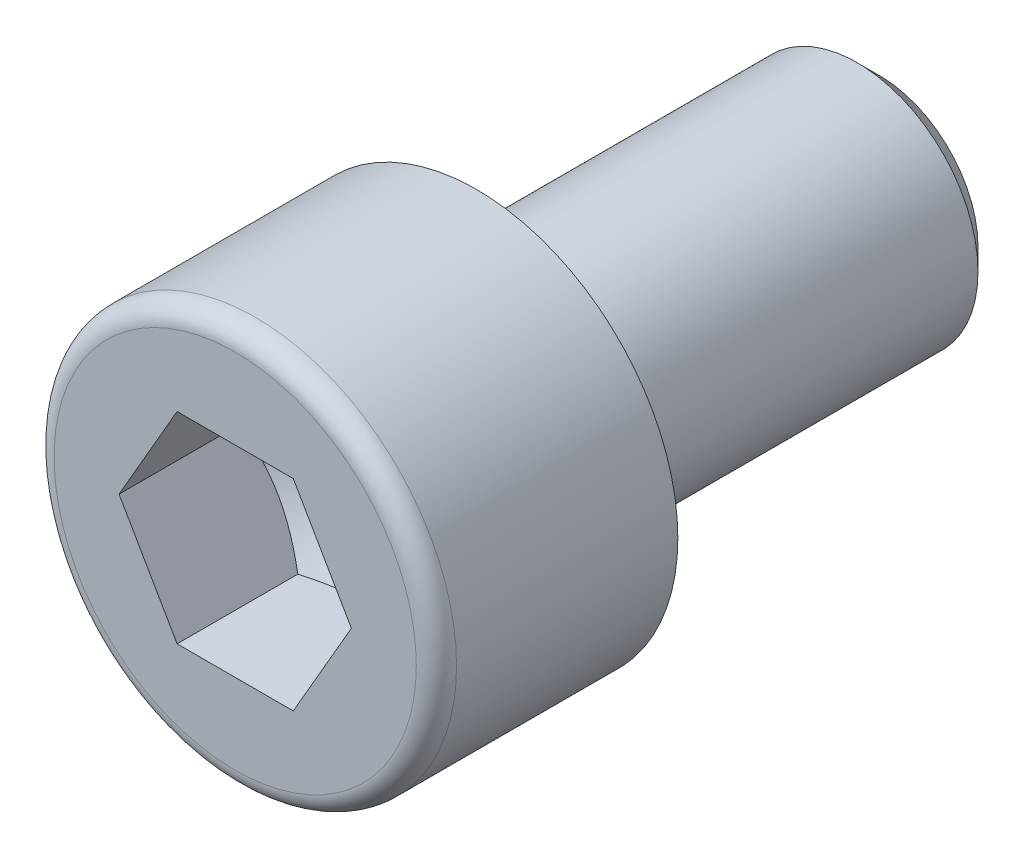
ISO-10303-21;
HEADER;
FILE_DESCRIPTION(('STEP AP214'),'2;1');
FILE_NAME('part.step','',(''),(''),'','','');
FILE_SCHEMA(('AUTOMOTIVE_DESIGN { 1 0 10303 214 1 1 1 1 }'));
ENDSEC;
DATA;
#1=APPLICATION_CONTEXT('core data for automotive mechanical design processes');
#2=APPLICATION_PROTOCOL_DEFINITION('international standard','automotive_design',2000,#1);
#3=PRODUCT_CONTEXT('',#1,'mechanical');
#4=PRODUCT('Part','Part','',(#3));
#5=PRODUCT_RELATED_PRODUCT_CATEGORY('part','',(#4));
#6=PRODUCT_DEFINITION_FORMATION('','',#4);
#7=PRODUCT_DEFINITION_CONTEXT('part definition',#1,'design');
#8=PRODUCT_DEFINITION('design','',#6,#7);
#9=PRODUCT_DEFINITION_SHAPE('','',#8);
#10=(LENGTH_UNIT() NAMED_UNIT(*) SI_UNIT(.MILLI.,.METRE.));
#11=(NAMED_UNIT(*) PLANE_ANGLE_UNIT() SI_UNIT($,.RADIAN.));
#12=(NAMED_UNIT(*) SI_UNIT($,.STERADIAN.) SOLID_ANGLE_UNIT());
#13=UNCERTAINTY_MEASURE_WITH_UNIT(LENGTH_MEASURE(1.E-05),#10,'distance_accuracy_value','');
#14=(GEOMETRIC_REPRESENTATION_CONTEXT(3) GLOBAL_UNCERTAINTY_ASSIGNED_CONTEXT((#13)) GLOBAL_UNIT_ASSIGNED_CONTEXT((#10,
#11,#12)) REPRESENTATION_CONTEXT('',''));
#15=CARTESIAN_POINT('',(0.,0.,0.));
#16=DIRECTION('',(0.,0.,1.));
#17=DIRECTION('',(1.,0.,0.));
#18=AXIS2_PLACEMENT_3D('',#15,#16,#17);
#19=CARTESIAN_POINT('',(0.,0.,6.));
#20=DIRECTION('',(0.,0.,1.));
#21=DIRECTION('',(1.,0.,0.));
#22=AXIS2_PLACEMENT_3D('',#19,#20,#21);
#23=PLANE('',#22);
#24=CARTESIAN_POINT('',(0.,0.,6.));
#25=DIRECTION('',(0.,0.,1.));
#26=DIRECTION('',(1.,0.,0.));
#27=AXIS2_PLACEMENT_3D('',#24,#25,#26);
#28=CIRCLE('',#27,4.5);
#29=CARTESIAN_POINT('',(4.5,0.,6.));
#30=VERTEX_POINT('',#29);
#31=EDGE_CURVE('E11',#30,#30,#28,.T.);
#32=ORIENTED_EDGE('',*,*,#31,.T.);
#33=EDGE_LOOP('',(#32));
#34=FACE_BOUND('',#33,.T.);
#35=DIRECTION('',(1.,0.,0.));
#36=VECTOR('',#35,1.);
#37=CARTESIAN_POINT('',(-1.44337499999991,2.49999883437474,6.));
#38=LINE('',#37,#36);
#39=CARTESIAN_POINT('',(-1.44337499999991,2.49999883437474,6.));
#40=VERTEX_POINT('',#39);
#41=CARTESIAN_POINT('',(1.44337500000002,2.49999883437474,5.99999999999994));
#42=VERTEX_POINT('',#41);
#43=EDGE_CURVE('E92',#40,#42,#38,.T.);
#44=ORIENTED_EDGE('',*,*,#43,.T.);
#45=DIRECTION('',(0.500000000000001,-0.866025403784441,0.));
#46=VECTOR('',#45,1.);
#47=CARTESIAN_POINT('',(1.44337500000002,2.49999883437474,5.99999999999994));
#48=LINE('',#47,#46);
#49=CARTESIAN_POINT('',(2.88675000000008,0.,6.));
#50=VERTEX_POINT('',#49);
#51=EDGE_CURVE('E31',#42,#50,#48,.T.);
#52=ORIENTED_EDGE('',*,*,#51,.T.);
#53=DIRECTION('',(-0.5,-0.866025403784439,0.));
#54=VECTOR('',#53,1.);
#55=CARTESIAN_POINT('',(2.88675000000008,0.,6.));
#56=LINE('',#55,#54);
#57=CARTESIAN_POINT('',(1.44337500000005,-2.49999883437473,5.99999999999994));
#58=VERTEX_POINT('',#57);
#59=EDGE_CURVE('E172',#50,#58,#56,.T.);
#60=ORIENTED_EDGE('',*,*,#59,.T.);
#61=DIRECTION('',(-1.,0.,0.));
#62=VECTOR('',#61,1.);
#63=CARTESIAN_POINT('',(1.44337500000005,-2.49999883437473,5.99999999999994));
#64=LINE('',#63,#62);
#65=CARTESIAN_POINT('',(-1.44337500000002,-2.49999883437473,6.));
#66=VERTEX_POINT('',#65);
#67=EDGE_CURVE('E168',#58,#66,#64,.T.);
#68=ORIENTED_EDGE('',*,*,#67,.T.);
#69=DIRECTION('',(-0.500000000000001,0.866025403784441,0.));
#70=VECTOR('',#69,1.);
#71=CARTESIAN_POINT('',(-1.44337500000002,-2.49999883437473,6.));
#72=LINE('',#71,#70);
#73=CARTESIAN_POINT('',(-2.88674999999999,0.,5.99999999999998));
#74=VERTEX_POINT('',#73);
#75=EDGE_CURVE('E163',#66,#74,#72,.T.);
#76=ORIENTED_EDGE('',*,*,#75,.T.);
#77=DIRECTION('',(0.5,0.866025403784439,0.));
#78=VECTOR('',#77,1.);
#79=CARTESIAN_POINT('',(-2.88674999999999,0.,5.99999999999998));
#80=LINE('',#79,#78);
#81=EDGE_CURVE('E96',#74,#40,#80,.T.);
#82=ORIENTED_EDGE('',*,*,#81,.T.);
#83=EDGE_LOOP('',(#44,#52,#60,#68,#76,#82));
#84=FACE_BOUND('',#83,.T.);
#85=ADVANCED_FACE('F17',(#34,#84),#23,.T.);
#86=CARTESIAN_POINT('',(0.,0.,5.5));
#87=DIRECTION('',(0.,0.,1.));
#88=DIRECTION('',(1.,0.,0.));
#89=AXIS2_PLACEMENT_3D('',#86,#87,#88);
#90=TOROIDAL_SURFACE('',#89,4.5,0.5);
#91=ORIENTED_EDGE('',*,*,#31,.F.);
#92=EDGE_LOOP('',(#91));
#93=FACE_BOUND('',#92,.T.);
#94=CARTESIAN_POINT('',(0.,0.,5.5));
#95=DIRECTION('',(0.,0.,1.));
#96=DIRECTION('',(1.,0.,0.));
#97=AXIS2_PLACEMENT_3D('',#94,#95,#96);
#98=CIRCLE('',#97,5.);
#99=CARTESIAN_POINT('',(5.00000000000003,0.,5.5));
#100=VERTEX_POINT('',#99);
#101=EDGE_CURVE('E24',#100,#100,#98,.T.);
#102=ORIENTED_EDGE('',*,*,#101,.T.);
#103=EDGE_LOOP('',(#102));
#104=FACE_BOUND('',#103,.T.);
#105=ADVANCED_FACE('F133',(#93,#104),#90,.T.);
#106=CARTESIAN_POINT('',(0.,0.,6.));
#107=DIRECTION('',(0.,0.,1.));
#108=DIRECTION('',(1.,0.,0.));
#109=AXIS2_PLACEMENT_3D('',#106,#107,#108);
#110=CYLINDRICAL_SURFACE('',#109,5.);
#111=CARTESIAN_POINT('',(0.,0.,0.));
#112=DIRECTION('',(0.,0.,1.));
#113=DIRECTION('',(1.,0.,0.));
#114=AXIS2_PLACEMENT_3D('',#111,#112,#113);
#115=CIRCLE('',#114,5.);
#116=CARTESIAN_POINT('',(5.,0.,0.));
#117=VERTEX_POINT('',#116);
#118=EDGE_CURVE('E128',#117,#117,#115,.T.);
#119=ORIENTED_EDGE('',*,*,#118,.T.);
#120=EDGE_LOOP('',(#119));
#121=FACE_BOUND('',#120,.T.);
#122=ORIENTED_EDGE('',*,*,#101,.F.);
#123=EDGE_LOOP('',(#122));
#124=FACE_BOUND('',#123,.T.);
#125=ADVANCED_FACE('F135',(#121,#124),#110,.T.);
#126=CARTESIAN_POINT('',(0.,5.00000000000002,0.));
#127=DIRECTION('',(0.,0.,-1.));
#128=DIRECTION('',(-1.,0.,0.));
#129=AXIS2_PLACEMENT_3D('',#126,#127,#128);
#130=PLANE('',#129);
#131=CARTESIAN_POINT('',(0.,0.,0.));
#132=DIRECTION('',(0.,0.,1.));
#133=DIRECTION('',(1.,0.,0.));
#134=AXIS2_PLACEMENT_3D('',#131,#132,#133);
#135=CIRCLE('',#134,3.3);
#136=CARTESIAN_POINT('',(3.3,0.,0.));
#137=VERTEX_POINT('',#136);
#138=EDGE_CURVE('E125',#137,#137,#135,.T.);
#139=ORIENTED_EDGE('',*,*,#138,.T.);
#140=EDGE_LOOP('',(#139));
#141=FACE_BOUND('',#140,.T.);
#142=ORIENTED_EDGE('',*,*,#118,.F.);
#143=EDGE_LOOP('',(#142));
#144=FACE_BOUND('',#143,.T.);
#145=ADVANCED_FACE('F137',(#141,#144),#130,.T.);
#146=CARTESIAN_POINT('',(0.,0.,-0.300000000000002));
#147=DIRECTION('',(0.,0.,1.));
#148=DIRECTION('',(1.,0.,0.));
#149=AXIS2_PLACEMENT_3D('',#146,#147,#148);
#150=TOROIDAL_SURFACE('',#149,3.3,0.3);
#151=CARTESIAN_POINT('',(0.,0.,-0.300000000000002));
#152=DIRECTION('',(0.,0.,1.));
#153=DIRECTION('',(1.,0.,0.));
#154=AXIS2_PLACEMENT_3D('',#151,#152,#153);
#155=CIRCLE('',#154,3.);
#156=CARTESIAN_POINT('',(3.,0.,-0.300000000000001));
#157=VERTEX_POINT('',#156);
#158=EDGE_CURVE('E122',#157,#157,#155,.T.);
#159=ORIENTED_EDGE('',*,*,#158,.T.);
#160=EDGE_LOOP('',(#159));
#161=FACE_BOUND('',#160,.T.);
#162=ORIENTED_EDGE('',*,*,#138,.F.);
#163=EDGE_LOOP('',(#162));
#164=FACE_BOUND('',#163,.T.);
#165=ADVANCED_FACE('F145',(#161,#164),#150,.F.);
#166=CARTESIAN_POINT('',(0.,0.,6.));
#167=DIRECTION('',(0.,0.,1.));
#168=DIRECTION('',(1.,0.,0.));
#169=AXIS2_PLACEMENT_3D('',#166,#167,#168);
#170=CYLINDRICAL_SURFACE('',#169,3.);
#171=CARTESIAN_POINT('',(0.,0.,-0.301000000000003));
#172=DIRECTION('',(0.,0.,1.));
#173=DIRECTION('',(1.,0.,0.));
#174=AXIS2_PLACEMENT_3D('',#171,#172,#173);
#175=CIRCLE('',#174,3.);
#176=CARTESIAN_POINT('',(3.,0.,-0.301000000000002));
#177=VERTEX_POINT('',#176);
#178=EDGE_CURVE('E119',#177,#177,#175,.T.);
#179=ORIENTED_EDGE('',*,*,#178,.T.);
#180=EDGE_LOOP('',(#179));
#181=FACE_BOUND('',#180,.T.);
#182=ORIENTED_EDGE('',*,*,#158,.F.);
#183=EDGE_LOOP('',(#182));
#184=FACE_BOUND('',#183,.T.);
#185=ADVANCED_FACE('F289',(#181,#184),#170,.T.);
#186=CARTESIAN_POINT('',(0.,0.,-0.301000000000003));
#187=DIRECTION('',(0.,0.,1.));
#188=DIRECTION('',(1.,0.,0.));
#189=AXIS2_PLACEMENT_3D('',#186,#187,#188);
#190=CONICAL_SURFACE('',#189,3.,0.523598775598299);
#191=CARTESIAN_POINT('',(0.,0.,-1.23847249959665));
#192=DIRECTION('',(0.,0.,1.));
#193=DIRECTION('',(1.,0.,0.));
#194=AXIS2_PLACEMENT_3D('',#191,#192,#193);
#195=CIRCLE('',#194,2.45875);
#196=CARTESIAN_POINT('',(2.45875,0.,-1.23847249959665));
#197=VERTEX_POINT('',#196);
#198=EDGE_CURVE('E116',#197,#197,#195,.T.);
#199=ORIENTED_EDGE('',*,*,#198,.T.);
#200=EDGE_LOOP('',(#199));
#201=FACE_BOUND('',#200,.T.);
#202=ORIENTED_EDGE('',*,*,#178,.F.);
#203=EDGE_LOOP('',(#202));
#204=FACE_BOUND('',#203,.T.);
#205=ADVANCED_FACE('F281',(#201,#204),#190,.T.);
#206=CARTESIAN_POINT('',(0.,2.45874999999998,-1.23847249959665));
#207=DIRECTION('',(0.,0.,1.));
#208=DIRECTION('',(1.,0.,0.));
#209=AXIS2_PLACEMENT_3D('',#206,#207,#208);
#210=PLANE('',#209);
#211=CARTESIAN_POINT('',(0.,0.,-1.23847249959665));
#212=DIRECTION('',(0.,0.,1.));
#213=DIRECTION('',(1.,0.,0.));
#214=AXIS2_PLACEMENT_3D('',#211,#212,#213);
#215=CIRCLE('',#214,3.);
#216=CARTESIAN_POINT('',(3.,0.,-1.23847249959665));
#217=VERTEX_POINT('',#216);
#218=EDGE_CURVE('E113',#217,#217,#215,.T.);
#219=ORIENTED_EDGE('',*,*,#218,.T.);
#220=EDGE_LOOP('',(#219));
#221=FACE_BOUND('',#220,.T.);
#222=ORIENTED_EDGE('',*,*,#198,.F.);
#223=EDGE_LOOP('',(#222));
#224=FACE_BOUND('',#223,.T.);
#225=ADVANCED_FACE('F270',(#221,#224),#210,.T.);
#226=CARTESIAN_POINT('',(0.,0.,6.));
#227=DIRECTION('',(0.,0.,1.));
#228=DIRECTION('',(1.,0.,0.));
#229=AXIS2_PLACEMENT_3D('',#226,#227,#228);
#230=CYLINDRICAL_SURFACE('',#229,3.);
#231=CARTESIAN_POINT('',(0.,0.,-9.45875));
#232=DIRECTION('',(0.,0.,1.));
#233=DIRECTION('',(1.,0.,0.));
#234=AXIS2_PLACEMENT_3D('',#231,#232,#233);
#235=CIRCLE('',#234,3.);
#236=CARTESIAN_POINT('',(3.,0.,-9.45875));
#237=VERTEX_POINT('',#236);
#238=EDGE_CURVE('E110',#237,#237,#235,.T.);
#239=ORIENTED_EDGE('',*,*,#238,.T.);
#240=EDGE_LOOP('',(#239));
#241=FACE_BOUND('',#240,.T.);
#242=ORIENTED_EDGE('',*,*,#218,.F.);
#243=EDGE_LOOP('',(#242));
#244=FACE_BOUND('',#243,.T.);
#245=ADVANCED_FACE('F261',(#241,#244),#230,.T.);
#246=CARTESIAN_POINT('',(0.,0.,-9.45875));
#247=DIRECTION('',(0.,0.,1.));
#248=DIRECTION('',(1.,0.,0.));
#249=AXIS2_PLACEMENT_3D('',#246,#247,#248);
#250=CONICAL_SURFACE('',#249,3.,0.785398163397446);
#251=CARTESIAN_POINT('',(0.,0.,-10.));
#252=DIRECTION('',(0.,0.,1.));
#253=DIRECTION('',(1.,0.,0.));
#254=AXIS2_PLACEMENT_3D('',#251,#252,#253);
#255=CIRCLE('',#254,2.45875);
#256=CARTESIAN_POINT('',(2.45875,0.,-10.));
#257=VERTEX_POINT('',#256);
#258=EDGE_CURVE('E107',#257,#257,#255,.T.);
#259=ORIENTED_EDGE('',*,*,#258,.T.);
#260=EDGE_LOOP('',(#259));
#261=FACE_BOUND('',#260,.T.);
#262=ORIENTED_EDGE('',*,*,#238,.F.);
#263=EDGE_LOOP('',(#262));
#264=FACE_BOUND('',#263,.T.);
#265=ADVANCED_FACE('F254',(#261,#264),#250,.T.);
#266=CARTESIAN_POINT('',(0.,2.45875000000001,-10.));
#267=DIRECTION('',(0.,0.,-1.));
#268=DIRECTION('',(-1.,0.,0.));
#269=AXIS2_PLACEMENT_3D('',#266,#267,#268);
#270=PLANE('',#269);
#271=ORIENTED_EDGE('',*,*,#258,.F.);
#272=EDGE_LOOP('',(#271));
#273=FACE_BOUND('',#272,.T.);
#274=ADVANCED_FACE('F228',(#273),#270,.T.);
#275=CARTESIAN_POINT('',(1.44337500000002,2.49999883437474,1.33333411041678));
#276=DIRECTION('',(-0.866025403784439,-0.5,0.));
#277=DIRECTION('',(-0.500000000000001,0.866025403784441,0.));
#278=AXIS2_PLACEMENT_3D('',#275,#276,#277);
#279=PLANE('',#278);
#280=DIRECTION('',(0.,0.,1.));
#281=VECTOR('',#280,1.);
#282=CARTESIAN_POINT('',(2.8867500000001,0.,1.33333411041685));
#283=LINE('',#282,#281);
#284=CARTESIAN_POINT('',(2.88675000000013,0.,3.));
#285=VERTEX_POINT('',#284);
#286=EDGE_CURVE('E105',#285,#50,#283,.T.);
#287=ORIENTED_EDGE('',*,*,#286,.T.);
#288=ORIENTED_EDGE('',*,*,#51,.F.);
#289=DIRECTION('',(0.,0.,1.));
#290=VECTOR('',#289,1.);
#291=CARTESIAN_POINT('',(1.44337500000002,2.49999883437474,1.33333411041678));
#292=LINE('',#291,#290);
#293=CARTESIAN_POINT('',(1.44337500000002,2.49999883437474,2.99999999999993));
#294=VERTEX_POINT('',#293);
#295=EDGE_CURVE('E86',#294,#42,#292,.T.);
#296=ORIENTED_EDGE('',*,*,#295,.F.);
#297=CARTESIAN_POINT('',(2.8867501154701,-1.99999988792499E-07,3.00000006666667));
#298=CARTESIAN_POINT('',(2.82332252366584,0.109859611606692,2.96336950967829));
#299=CARTESIAN_POINT('',(2.75934742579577,0.220667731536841,2.93005593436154));
#300=CARTESIAN_POINT('',(2.6302895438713,0.444202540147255,2.87190808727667));
#301=CARTESIAN_POINT('',(2.56520446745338,0.556933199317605,2.84709438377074));
#302=CARTESIAN_POINT('',(2.43584088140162,0.780997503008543,2.80847006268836));
#303=CARTESIAN_POINT('',(2.3715822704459,0.892296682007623,2.79440234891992));
#304=CARTESIAN_POINT('',(2.24276284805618,1.11541846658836,2.77761157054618));
#305=CARTESIAN_POINT('',(2.17820250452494,1.22724026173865,2.77487459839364));
#306=CARTESIAN_POINT('',(2.05757841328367,1.43616731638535,2.78058295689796));
#307=CARTESIAN_POINT('',(2.00149656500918,1.53330392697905,2.78762669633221));
#308=CARTESIAN_POINT('',(1.88969822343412,1.72694433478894,2.80994670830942));
#309=CARTESIAN_POINT('',(1.83398211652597,1.82344746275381,2.82523059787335));
#310=CARTESIAN_POINT('',(1.72195345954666,2.01748678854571,2.86343736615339));
#311=CARTESIAN_POINT('',(1.66565508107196,2.11499844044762,2.88652212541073));
#312=CARTESIAN_POINT('',(1.55389777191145,2.3085677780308,2.93891477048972));
#313=CARTESIAN_POINT('',(1.49843741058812,2.4046279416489,2.96821035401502));
#314=CARTESIAN_POINT('',(1.44337488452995,2.49999903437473,3.00000006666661));
#315=B_SPLINE_CURVE_WITH_KNOTS('',3,(#297,#298,#299,#300,#301,#302,#303,#304,#305,#306,#307,
#308,#309,#310,#311,#312,#313,#314),.UNSPECIFIED.,.F.,.F.,(4,2,2,2,2,2,2,2,4),(0.,
0.396269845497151,0.793491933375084,1.18088400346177,1.56780044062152,1.90463400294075,
2.24177946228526,2.58640119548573,2.93034658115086),.UNSPECIFIED.);
#316=EDGE_CURVE('E79',#285,#294,#315,.T.);
#317=ORIENTED_EDGE('',*,*,#316,.F.);
#318=EDGE_LOOP('',(#287,#288,#296,#317));
#319=FACE_BOUND('',#318,.T.);
#320=ADVANCED_FACE('F87',(#319),#279,.T.);
#321=CARTESIAN_POINT('',(2.8867500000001,0.,1.33333411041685));
#322=DIRECTION('',(-0.86602540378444,0.500000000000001,0.));
#323=DIRECTION('',(0.5,0.866025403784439,0.));
#324=AXIS2_PLACEMENT_3D('',#321,#322,#323);
#325=PLANE('',#324);
#326=DIRECTION('',(0.,0.,1.));
#327=VECTOR('',#326,1.);
#328=CARTESIAN_POINT('',(1.44337500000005,-2.49999883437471,1.33333411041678));
#329=LINE('',#328,#327);
#330=CARTESIAN_POINT('',(1.44337500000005,-2.49999883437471,2.99999999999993));
#331=VERTEX_POINT('',#330);
#332=EDGE_CURVE('E103',#331,#58,#329,.T.);
#333=ORIENTED_EDGE('',*,*,#332,.T.);
#334=ORIENTED_EDGE('',*,*,#59,.F.);
#335=ORIENTED_EDGE('',*,*,#286,.F.);
#336=CARTESIAN_POINT('',(1.44337488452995,-2.49999903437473,3.00000006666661));
#337=CARTESIAN_POINT('',(1.50680247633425,-2.39013922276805,2.96336950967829));
#338=CARTESIAN_POINT('',(1.57077757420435,-2.27933110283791,2.93005593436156));
#339=CARTESIAN_POINT('',(1.69983545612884,-2.05579629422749,2.87190808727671));
#340=CARTESIAN_POINT('',(1.76492053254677,-1.94306563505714,2.84709438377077));
#341=CARTESIAN_POINT('',(1.89428411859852,-1.71900133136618,2.8084700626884));
#342=CARTESIAN_POINT('',(1.95854272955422,-1.60770215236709,2.79440234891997));
#343=CARTESIAN_POINT('',(2.08736215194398,-1.38458036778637,2.77761157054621));
#344=CARTESIAN_POINT('',(2.15192249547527,-1.2727585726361,2.77487459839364));
#345=CARTESIAN_POINT('',(2.27254658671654,-1.0638315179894,2.78058295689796));
#346=CARTESIAN_POINT('',(2.32862843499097,-0.966694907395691,2.78762669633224));
#347=CARTESIAN_POINT('',(2.440426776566,-0.773054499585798,2.80994670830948));
#348=CARTESIAN_POINT('',(2.49614288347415,-0.676551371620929,2.8252305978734));
#349=CARTESIAN_POINT('',(2.60817154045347,-0.482512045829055,2.86343736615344));
#350=CARTESIAN_POINT('',(2.66446991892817,-0.38500039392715,2.88652212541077));
#351=CARTESIAN_POINT('',(2.77622722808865,-0.19143105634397,2.93891477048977));
#352=CARTESIAN_POINT('',(2.83168758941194,-0.0953708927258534,2.96821035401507));
#353=CARTESIAN_POINT('',(2.88675011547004,2.00000002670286E-07,3.00000006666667));
#354=B_SPLINE_CURVE_WITH_KNOTS('',3,(#336,#337,#338,#339,#340,#341,#342,#343,#344,#345,#346,
#347,#348,#349,#350,#351,#352,#353),.UNSPECIFIED.,.F.,.F.,(4,2,2,2,2,2,2,2,4),(0.,
0.396269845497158,0.793491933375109,1.1808840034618,1.56780044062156,1.90463400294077,
2.24177946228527,2.58640119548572,2.93034658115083),.UNSPECIFIED.);
#355=EDGE_CURVE('E83',#331,#285,#354,.T.);
#356=ORIENTED_EDGE('',*,*,#355,.F.);
#357=EDGE_LOOP('',(#333,#334,#335,#356));
#358=FACE_BOUND('',#357,.T.);
#359=ADVANCED_FACE('F218',(#358),#325,.T.);
#360=CARTESIAN_POINT('',(1.44337500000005,-2.49999883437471,1.33333411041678));
#361=DIRECTION('',(0.,1.,0.));
#362=DIRECTION('',(1.,0.,0.));
#363=AXIS2_PLACEMENT_3D('',#360,#361,#362);
#364=PLANE('',#363);
#365=DIRECTION('',(0.,0.,1.));
#366=VECTOR('',#365,1.);
#367=CARTESIAN_POINT('',(-1.44337500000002,-2.49999883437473,1.33333411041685));
#368=LINE('',#367,#366);
#369=CARTESIAN_POINT('',(-1.44337499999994,-2.49999883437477,3.));
#370=VERTEX_POINT('',#369);
#371=EDGE_CURVE('E101',#370,#66,#368,.T.);
#372=ORIENTED_EDGE('',*,*,#371,.T.);
#373=ORIENTED_EDGE('',*,*,#67,.F.);
#374=ORIENTED_EDGE('',*,*,#332,.F.);
#375=CARTESIAN_POINT('',(-3.73786106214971,-2.49999883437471,3.92958778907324));
#376=CARTESIAN_POINT('',(-3.62896491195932,-2.49999883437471,3.87734398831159));
#377=CARTESIAN_POINT('',(-3.51980131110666,-2.49999883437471,3.8256470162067));
#378=CARTESIAN_POINT('',(-3.30079453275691,-2.49999883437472,3.72366066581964));
#379=CARTESIAN_POINT('',(-3.19095123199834,-2.49999883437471,3.6733715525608));
#380=CARTESIAN_POINT('',(-2.96980741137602,-2.49999883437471,3.5742326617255));
#381=CARTESIAN_POINT('',(-2.85850208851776,-2.49999883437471,3.52539355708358));
#382=CARTESIAN_POINT('',(-2.63494533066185,-2.49999883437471,3.42993961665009));
#383=CARTESIAN_POINT('',(-2.52269394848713,-2.49999883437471,3.38332465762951));
#384=CARTESIAN_POINT('',(-2.29607962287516,-2.49999883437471,3.29252281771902));
#385=CARTESIAN_POINT('',(-2.18170681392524,-2.49999883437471,3.24836041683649));
#386=CARTESIAN_POINT('',(-1.95158478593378,-2.49999883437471,3.16370836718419));
#387=CARTESIAN_POINT('',(-1.83583541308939,-2.49999883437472,3.12321913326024));
#388=CARTESIAN_POINT('',(-1.60304799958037,-2.49999883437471,3.04706130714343));
#389=CARTESIAN_POINT('',(-1.48601365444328,-2.49999883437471,3.01138153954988));
#390=CARTESIAN_POINT('',(-1.25028155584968,-2.49999883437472,2.94604587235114));
#391=CARTESIAN_POINT('',(-1.13158421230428,-2.49999883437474,2.91638851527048));
#392=CARTESIAN_POINT('',(-0.892146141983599,-2.49999883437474,2.86451911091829));
#393=CARTESIAN_POINT('',(-0.771400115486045,-2.49999883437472,2.84233105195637));
#394=CARTESIAN_POINT('',(-0.52855053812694,-2.49999883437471,2.80705675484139));
#395=CARTESIAN_POINT('',(-0.406446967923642,-2.49999883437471,2.79397064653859));
#396=CARTESIAN_POINT('',(-0.162227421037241,-2.49999883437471,2.77805851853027));
#397=CARTESIAN_POINT('',(-0.0401151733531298,-2.4999988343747,2.77517671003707));
#398=CARTESIAN_POINT('',(0.203885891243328,-2.49999883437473,2.77978959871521));
#399=CARTESIAN_POINT('',(0.325774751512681,-2.49999883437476,2.78728200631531));
#400=CARTESIAN_POINT('',(0.536617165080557,-2.49999883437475,2.80870547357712));
#401=CARTESIAN_POINT('',(0.625806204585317,-2.49999883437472,2.82042640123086));
#402=CARTESIAN_POINT('',(0.803437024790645,-2.4999988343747,2.84861382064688));
#403=CARTESIAN_POINT('',(0.891878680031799,-2.49999883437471,2.86508109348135));
#404=CARTESIAN_POINT('',(1.15624928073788,-2.49999883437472,2.92077504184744));
#405=CARTESIAN_POINT('',(1.33087080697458,-2.49999883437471,2.9662535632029));
#406=CARTESIAN_POINT('',(1.59190160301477,-2.49999883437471,3.0439316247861));
#407=CARTESIAN_POINT('',(1.67969059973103,-2.49999883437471,3.07174956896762));
#408=CARTESIAN_POINT('',(1.85442096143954,-2.49999883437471,3.12997740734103));
#409=CARTESIAN_POINT('',(1.94136225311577,-2.49999883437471,3.16038752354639));
#410=CARTESIAN_POINT('',(2.11396102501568,-2.49999883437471,3.22316216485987));
#411=CARTESIAN_POINT('',(2.19962301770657,-2.49999883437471,3.25551440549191));
#412=CARTESIAN_POINT('',(2.37023194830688,-2.49999883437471,3.32197432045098));
#413=CARTESIAN_POINT('',(2.4551791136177,-2.49999883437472,3.35608140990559));
#414=CARTESIAN_POINT('',(2.53982745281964,-2.49999883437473,3.3908988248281));
#415=B_SPLINE_CURVE_WITH_KNOTS('',3,(#375,#376,#377,#378,#379,#380,#381,#382,#383,#384,#385,
#386,#387,#388,#389,#390,#391,#392,#393,#394,#395,#396,#397,#398,#399,#400,#401,#402,#403,#404,
#405,#406,#407,#408,#409,#410,#411,#412,#413,#414),.UNSPECIFIED.,.F.,.F.,(4,2,2,2,2,2,2,2,2,2,2,
2,2,2,2,2,2,2,2,4),(0.,0.362345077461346,0.72475791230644,1.0893853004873,1.45399246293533,
1.82175226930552,2.18955355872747,2.55648491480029,2.92332736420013,3.29133696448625,
3.65935181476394,4.02535152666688,4.39127047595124,4.66100477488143,4.93078348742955,
5.47140222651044,5.74765583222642,6.02393312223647,6.2986168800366,6.57320967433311),.UNSPECIFIED.);
#416=EDGE_CURVE('E210',#370,#331,#415,.T.);
#417=ORIENTED_EDGE('',*,*,#416,.F.);
#418=EDGE_LOOP('',(#372,#373,#374,#417));
#419=FACE_BOUND('',#418,.T.);
#420=ADVANCED_FACE('F215',(#419),#364,.T.);
#421=CARTESIAN_POINT('',(-1.44337500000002,-2.49999883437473,1.33333411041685));
#422=DIRECTION('',(0.866025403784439,0.5,0.));
#423=DIRECTION('',(0.500000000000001,-0.866025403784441,0.));
#424=AXIS2_PLACEMENT_3D('',#421,#422,#423);
#425=PLANE('',#424);
#426=DIRECTION('',(0.,0.,1.));
#427=VECTOR('',#426,1.);
#428=CARTESIAN_POINT('',(-2.88674999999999,0.,1.33333411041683));
#429=LINE('',#428,#427);
#430=CARTESIAN_POINT('',(-2.88674999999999,0.,2.99999999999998));
#431=VERTEX_POINT('',#430);
#432=EDGE_CURVE('E94',#431,#74,#429,.T.);
#433=ORIENTED_EDGE('',*,*,#432,.T.);
#434=ORIENTED_EDGE('',*,*,#75,.F.);
#435=ORIENTED_EDGE('',*,*,#371,.F.);
#436=CARTESIAN_POINT('',(-2.88675011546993,1.99999974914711E-07,3.00000006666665));
#437=CARTESIAN_POINT('',(-2.82332252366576,-0.109859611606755,2.96336950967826));
#438=CARTESIAN_POINT('',(-2.75934742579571,-0.220667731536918,2.93005593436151));
#439=CARTESIAN_POINT('',(-2.63028954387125,-0.444202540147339,2.87190808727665));
#440=CARTESIAN_POINT('',(-2.56520446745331,-0.556933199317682,2.84709438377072));
#441=CARTESIAN_POINT('',(-2.43584088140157,-0.780997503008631,2.80847006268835));
#442=CARTESIAN_POINT('',(-2.37158227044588,-0.892296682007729,2.79440234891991));
#443=CARTESIAN_POINT('',(-2.24276284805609,-1.11541846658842,2.77761157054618));
#444=CARTESIAN_POINT('',(-2.17820250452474,-1.22724026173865,2.77487459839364));
#445=CARTESIAN_POINT('',(-2.05757841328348,-1.43616731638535,2.78058295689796));
#446=CARTESIAN_POINT('',(-2.0014965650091,-1.5333039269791,2.78762669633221));
#447=CARTESIAN_POINT('',(-1.88969822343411,-1.72694433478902,2.80994670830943));
#448=CARTESIAN_POINT('',(-1.83398211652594,-1.82344746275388,2.82523059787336));
#449=CARTESIAN_POINT('',(-1.72195345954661,-2.01748678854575,2.8634373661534));
#450=CARTESIAN_POINT('',(-1.66565508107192,-2.11499844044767,2.88652212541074));
#451=CARTESIAN_POINT('',(-1.55389777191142,-2.30856777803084,2.93891477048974));
#452=CARTESIAN_POINT('',(-1.49843741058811,-2.40462794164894,2.96821035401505));
#453=CARTESIAN_POINT('',(-1.44337488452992,-2.49999903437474,3.00000006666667));
#454=B_SPLINE_CURVE_WITH_KNOTS('',3,(#436,#437,#438,#439,#440,#441,#442,#443,#444,#445,#446,
#447,#448,#449,#450,#451,#452,#453),.UNSPECIFIED.,.F.,.F.,(4,2,2,2,2,2,2,2,4),(0.,
0.396269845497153,0.793491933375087,1.18088400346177,1.56780044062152,1.90463400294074,
2.24177946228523,2.58640119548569,2.9303465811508),.UNSPECIFIED.);
#455=EDGE_CURVE('E205',#431,#370,#454,.T.);
#456=ORIENTED_EDGE('',*,*,#455,.F.);
#457=EDGE_LOOP('',(#433,#434,#435,#456));
#458=FACE_BOUND('',#457,.T.);
#459=ADVANCED_FACE('F217',(#458),#425,.T.);
#460=CARTESIAN_POINT('',(-2.88674999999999,0.,1.33333411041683));
#461=DIRECTION('',(0.86602540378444,-0.500000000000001,0.));
#462=DIRECTION('',(-0.5,-0.866025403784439,0.));
#463=AXIS2_PLACEMENT_3D('',#460,#461,#462);
#464=PLANE('',#463);
#465=DIRECTION('',(0.,0.,1.));
#466=VECTOR('',#465,1.);
#467=CARTESIAN_POINT('',(-1.44337499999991,2.49999883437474,1.33333411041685));
#468=LINE('',#467,#466);
#469=CARTESIAN_POINT('',(-1.44337499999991,2.49999883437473,3.));
#470=VERTEX_POINT('',#469);
#471=EDGE_CURVE('E91',#470,#40,#468,.T.);
#472=ORIENTED_EDGE('',*,*,#471,.T.);
#473=ORIENTED_EDGE('',*,*,#81,.F.);
#474=ORIENTED_EDGE('',*,*,#432,.F.);
#475=CARTESIAN_POINT('',(-1.44337488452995,2.49999903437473,3.00000006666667));
#476=CARTESIAN_POINT('',(-1.50680247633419,2.39013922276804,2.96336950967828));
#477=CARTESIAN_POINT('',(-1.57077757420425,2.27933110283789,2.93005593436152));
#478=CARTESIAN_POINT('',(-1.69983545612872,2.05579629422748,2.87190808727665));
#479=CARTESIAN_POINT('',(-1.76492053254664,1.94306563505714,2.84709438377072));
#480=CARTESIAN_POINT('',(-1.8942841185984,1.71900133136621,2.80847006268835));
#481=CARTESIAN_POINT('',(-1.95854272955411,1.60770215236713,2.7944023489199));
#482=CARTESIAN_POINT('',(-2.08736215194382,1.3845803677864,2.77761157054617));
#483=CARTESIAN_POINT('',(-2.15192249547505,1.2727585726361,2.77487459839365));
#484=CARTESIAN_POINT('',(-2.27254658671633,1.0638315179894,2.78058295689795));
#485=CARTESIAN_POINT('',(-2.32862843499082,0.966694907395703,2.78762669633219));
#486=CARTESIAN_POINT('',(-2.44042677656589,0.773054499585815,2.8099467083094));
#487=CARTESIAN_POINT('',(-2.49614288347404,0.676551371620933,2.82523059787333));
#488=CARTESIAN_POINT('',(-2.60817154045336,0.482512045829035,2.86343736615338));
#489=CARTESIAN_POINT('',(-2.66446991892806,0.38500039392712,2.88652212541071));
#490=CARTESIAN_POINT('',(-2.77622722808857,0.191431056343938,2.93891477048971));
#491=CARTESIAN_POINT('',(-2.83168758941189,0.095370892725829,2.96821035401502));
#492=CARTESIAN_POINT('',(-2.88675011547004,-2.00000002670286E-07,3.00000006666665));
#493=B_SPLINE_CURVE_WITH_KNOTS('',3,(#475,#476,#477,#478,#479,#480,#481,#482,#483,#484,#485,
#486,#487,#488,#489,#490,#491,#492),.UNSPECIFIED.,.F.,.F.,(4,2,2,2,2,2,2,2,4),(0.,
0.396269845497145,0.793491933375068,1.18088400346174,1.56780044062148,1.90463400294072,
2.24177946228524,2.58640119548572,2.93034658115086),.UNSPECIFIED.);
#494=EDGE_CURVE('E39',#470,#431,#493,.T.);
#495=ORIENTED_EDGE('',*,*,#494,.F.);
#496=EDGE_LOOP('',(#472,#473,#474,#495));
#497=FACE_BOUND('',#496,.T.);
#498=ADVANCED_FACE('F162',(#497),#464,.T.);
#499=CARTESIAN_POINT('',(-1.44337499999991,2.49999883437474,1.33333411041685));
#500=DIRECTION('',(0.,-1.,0.));
#501=DIRECTION('',(-1.,0.,0.));
#502=AXIS2_PLACEMENT_3D('',#499,#500,#501);
#503=PLANE('',#502);
#504=ORIENTED_EDGE('',*,*,#295,.T.);
#505=ORIENTED_EDGE('',*,*,#43,.F.);
#506=ORIENTED_EDGE('',*,*,#471,.F.);
#507=CARTESIAN_POINT('',(-3.73786106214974,2.49999883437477,3.92958778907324));
#508=CARTESIAN_POINT('',(-3.62896491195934,2.49999883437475,3.8773439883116));
#509=CARTESIAN_POINT('',(-3.51980131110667,2.49999883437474,3.82564701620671));
#510=CARTESIAN_POINT('',(-3.30079453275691,2.49999883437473,3.72366066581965));
#511=CARTESIAN_POINT('',(-3.19095123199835,2.49999883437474,3.67337155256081));
#512=CARTESIAN_POINT('',(-2.96980741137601,2.49999883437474,3.5742326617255));
#513=CARTESIAN_POINT('',(-2.85850208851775,2.49999883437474,3.52539355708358));
#514=CARTESIAN_POINT('',(-2.63494533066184,2.49999883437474,3.42993961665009));
#515=CARTESIAN_POINT('',(-2.52269394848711,2.49999883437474,3.38332465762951));
#516=CARTESIAN_POINT('',(-2.29607962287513,2.49999883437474,3.29252281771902));
#517=CARTESIAN_POINT('',(-2.1817068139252,2.49999883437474,3.24836041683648));
#518=CARTESIAN_POINT('',(-1.95158478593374,2.49999883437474,3.16370836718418));
#519=CARTESIAN_POINT('',(-1.83583541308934,2.49999883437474,3.12321913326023));
#520=CARTESIAN_POINT('',(-1.60304799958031,2.49999883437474,3.04706130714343));
#521=CARTESIAN_POINT('',(-1.48601365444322,2.49999883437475,3.01138153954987));
#522=CARTESIAN_POINT('',(-1.25028155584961,2.49999883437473,2.94604587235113));
#523=CARTESIAN_POINT('',(-1.1315842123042,2.49999883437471,2.91638851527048));
#524=CARTESIAN_POINT('',(-0.892146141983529,2.49999883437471,2.8645191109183));
#525=CARTESIAN_POINT('',(-0.771400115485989,2.49999883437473,2.84233105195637));
#526=CARTESIAN_POINT('',(-0.528550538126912,2.49999883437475,2.80705675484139));
#527=CARTESIAN_POINT('',(-0.406446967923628,2.49999883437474,2.7939706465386));
#528=CARTESIAN_POINT('',(-0.162227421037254,2.49999883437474,2.77805851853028));
#529=CARTESIAN_POINT('',(-0.0401151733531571,2.49999883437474,2.77517671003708));
#530=CARTESIAN_POINT('',(0.203885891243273,2.49999883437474,2.77978959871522));
#531=CARTESIAN_POINT('',(0.325774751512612,2.49999883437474,2.78728200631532));
#532=CARTESIAN_POINT('',(0.536617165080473,2.49999883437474,2.80870547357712));
#533=CARTESIAN_POINT('',(0.625806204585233,2.49999883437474,2.82042640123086));
#534=CARTESIAN_POINT('',(0.803437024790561,2.49999883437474,2.84861382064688));
#535=CARTESIAN_POINT('',(0.891878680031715,2.49999883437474,2.86508109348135));
#536=CARTESIAN_POINT('',(1.1562492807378,2.49999883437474,2.92077504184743));
#537=CARTESIAN_POINT('',(1.3308708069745,2.49999883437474,2.96625356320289));
#538=CARTESIAN_POINT('',(1.59190160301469,2.49999883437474,3.04393162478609));
#539=CARTESIAN_POINT('',(1.67969059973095,2.49999883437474,3.0717495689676));
#540=CARTESIAN_POINT('',(1.85442096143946,2.49999883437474,3.12997740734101));
#541=CARTESIAN_POINT('',(1.94136225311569,2.49999883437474,3.16038752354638));
#542=CARTESIAN_POINT('',(2.11396102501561,2.49999883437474,3.22316216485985));
#543=CARTESIAN_POINT('',(2.1996230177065,2.49999883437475,3.25551440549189));
#544=CARTESIAN_POINT('',(2.3702319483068,2.49999883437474,3.32197432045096));
#545=CARTESIAN_POINT('',(2.45517911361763,2.49999883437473,3.35608140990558));
#546=CARTESIAN_POINT('',(2.53982745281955,2.49999883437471,3.3908988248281));
#547=B_SPLINE_CURVE_WITH_KNOTS('',3,(#507,#508,#509,#510,#511,#512,#513,#514,#515,#516,#517,
#518,#519,#520,#521,#522,#523,#524,#525,#526,#527,#528,#529,#530,#531,#532,#533,#534,#535,#536,
#537,#538,#539,#540,#541,#542,#543,#544,#545,#546),.UNSPECIFIED.,.F.,.F.,(4,2,2,2,2,2,2,2,2,2,2,
2,2,2,2,2,2,2,2,4),(0.,0.362345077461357,0.724757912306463,1.08938530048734,1.45399246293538,
1.82175226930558,2.18955355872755,2.55648491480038,2.92332736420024,3.29133696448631,
3.65935181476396,4.02535152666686,4.39127047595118,4.66100477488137,4.93078348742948,
5.47140222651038,5.74765583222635,6.02393312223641,6.29861688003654,6.57320967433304),.UNSPECIFIED.);
#548=EDGE_CURVE('E80',#294,#470,#547,.F.);
#549=ORIENTED_EDGE('',*,*,#548,.F.);
#550=EDGE_LOOP('',(#504,#505,#506,#549));
#551=FACE_BOUND('',#550,.T.);
#552=ADVANCED_FACE('F75',(#551),#503,.T.);
#553=CARTESIAN_POINT('',(0.,0.,1.33333411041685));
#554=DIRECTION('',(0.,0.,1.));
#555=DIRECTION('',(1.,0.,0.));
#556=AXIS2_PLACEMENT_3D('',#553,#554,#555);
#557=CONICAL_SURFACE('',#556,0.,1.0471975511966);
#558=CARTESIAN_POINT('',(0.,0.,1.33333411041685));
#559=VERTEX_POINT('',#558);
#560=VERTEX_LOOP('',#559);
#561=FACE_BOUND('',#560,.T.);
#562=ORIENTED_EDGE('',*,*,#316,.T.);
#563=ORIENTED_EDGE('',*,*,#548,.T.);
#564=ORIENTED_EDGE('',*,*,#494,.T.);
#565=ORIENTED_EDGE('',*,*,#455,.T.);
#566=ORIENTED_EDGE('',*,*,#416,.T.);
#567=ORIENTED_EDGE('',*,*,#355,.T.);
#568=EDGE_LOOP('',(#562,#563,#564,#565,#566,#567));
#569=FACE_BOUND('',#568,.T.);
#570=ADVANCED_FACE('F72',(#561,#569),#557,.F.);
#571=CLOSED_SHELL('',(#85,#105,#125,#145,#165,#185,#205,#225,#245,#265,#274,#320,#359,#420,#459,
#498,#552,#570));
#572=MANIFOLD_SOLID_BREP('B1',#571);
#573=ADVANCED_BREP_SHAPE_REPRESENTATION('',(#18,#572),#14);
#574=SHAPE_DEFINITION_REPRESENTATION(#9,#573);
ENDSEC;
END-ISO-10303-21;
